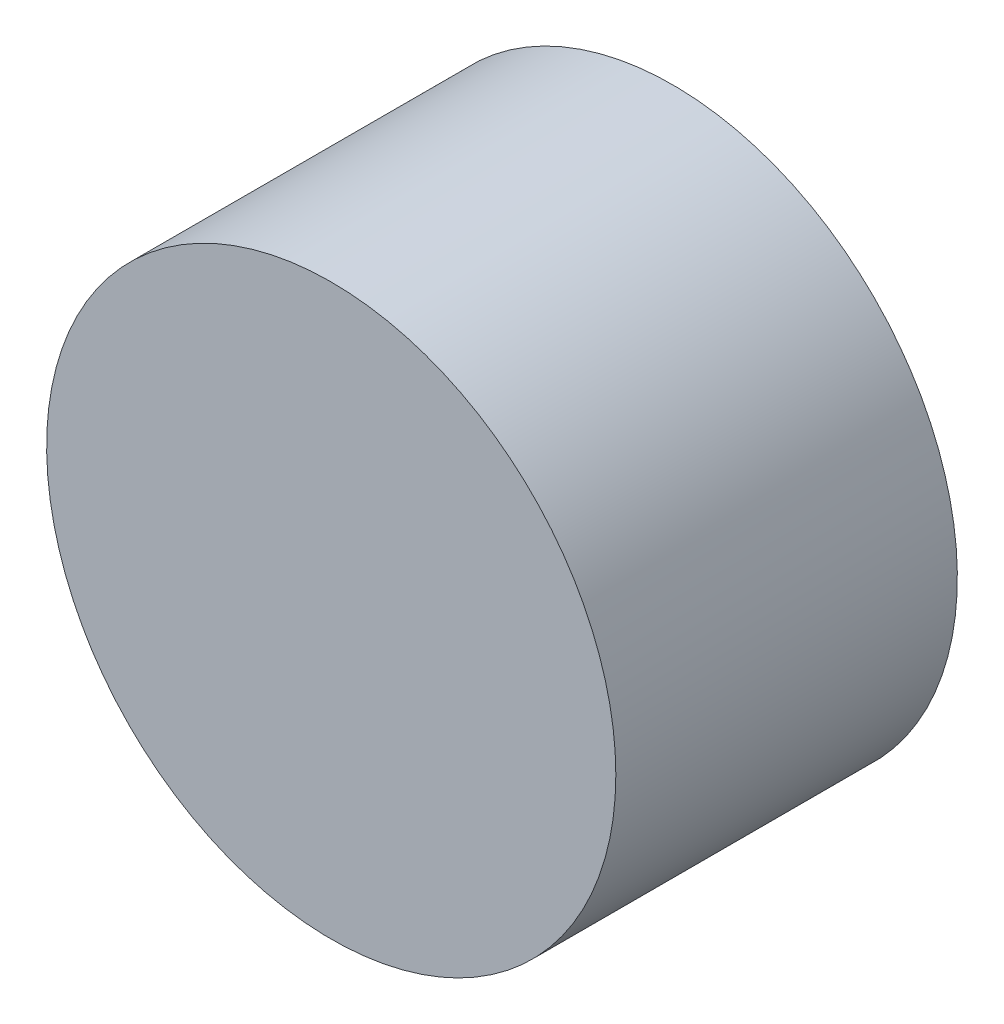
from build123d import *

# Parameters (mm, degrees)
ESQUISSE1_R             = 5
BASE_EXTRUSION_DEPTH    = 6
ENL_V_MAT_EXTRU_1_DEPTH = 1


with BuildPart() as part:
    # Esquisse1 → Base-Extrusion (new body)
    with BuildSketch(Plane.XY):
        with Locations(Location((0, 0, 0), (0, 0, 149.3096826))):
            Circle(ESQUISSE1_R)
    extrude(amount=BASE_EXTRUSION_DEPTH)

    # Esquisse2 → Enl_v. mat.-Extru.1 (cut)
    with BuildSketch(Plane(origin=(0, 0, 0), x_dir=(-1, 0, 0), z_dir=(0, 0, -1))):
        with BuildLine():
            Line((0, 0), (3.879348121, 3.154466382))
            ThreePointArc((3.879348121, 3.154466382), (4.100600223, 2.860957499), (4.299692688, 2.551988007))
            Line((4.299692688, 2.551988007), (0, 0))
        make_face()
    extrude(amount=-ENL_V_MAT_EXTRU_1_DEPTH, mode=Mode.SUBTRACT)


solid = part.part
